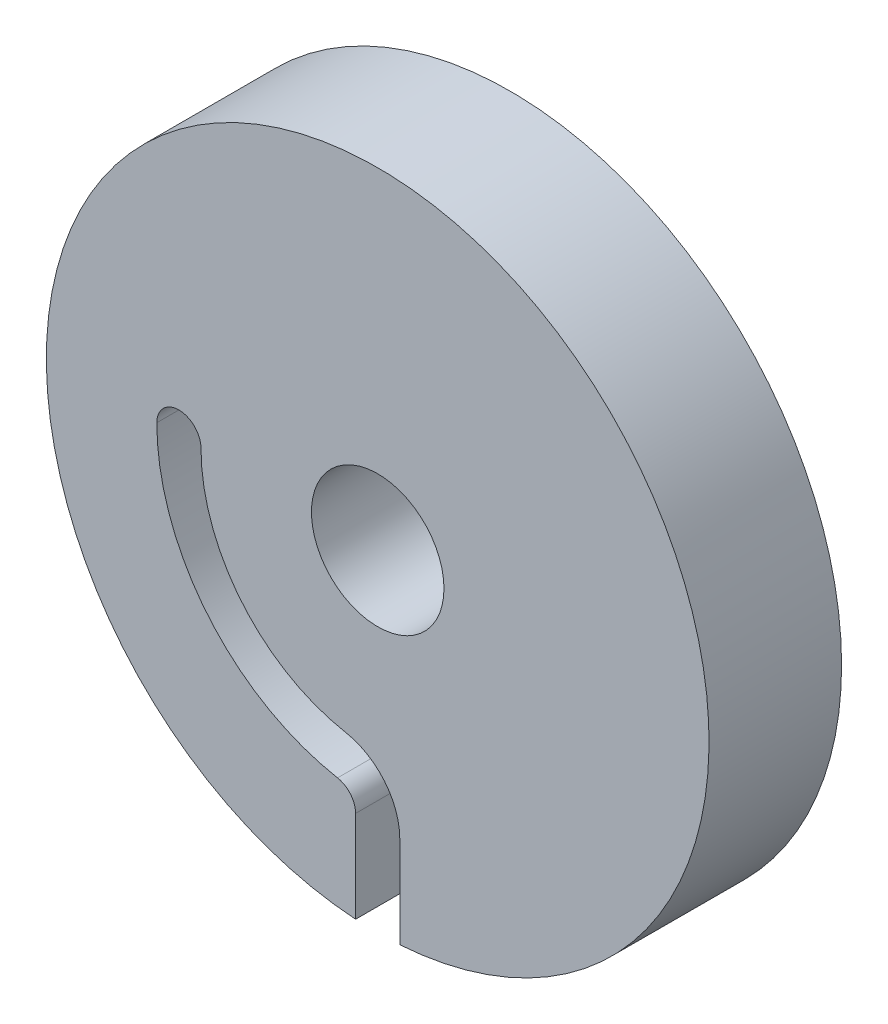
from build123d import *

# Parameters (mm, degrees)
ESQUISSE1_R             = 15
ESQUISSE1_R_2           = 3
EXTRUSION1_DEPTH        = 6
ENL_V_MAT_EXTRU_1_DEPTH = 2.3


with BuildPart() as part:
    # Esquisse1 → Extrusion1 (new body)
    with BuildSketch(Plane.XY):
        Circle(ESQUISSE1_R)
        Circle(ESQUISSE1_R_2, mode=Mode.SUBTRACT)
    extrude(amount=EXTRUSION1_DEPTH)

    # Esquisse2 → Enl_v. mat.-Extru.1 (cut)
    with BuildSketch(Plane.XY.offset(6)):
        with BuildLine():
            Line((-1, -10.816653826), (-1, -15.563234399))
            Line((-1, -15.563234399), (1, -15.563234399))
            Line((1, -15.563234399), (1, -10.816653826))
            ThreePointArc((1, -10.816653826), (0.306118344, -8.897847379), (-1.454545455, -7.866657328))
            ThreePointArc((-1.454545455, -7.866657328), (-6.149648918, -5.116817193), (-8, 0))
            ThreePointArc((-8, 0), (-9, 1), (-10, 0))
            ThreePointArc((-10, 0), (-7.687061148, -6.396021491), (-1.818181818, -9.83332166))
            ThreePointArc((-1.818181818, -9.83332166), (-1.231293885, -10.177051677), (-1, -10.816653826))
        make_face()
    extrude(amount=-ENL_V_MAT_EXTRU_1_DEPTH, mode=Mode.SUBTRACT)


solid = part.part
